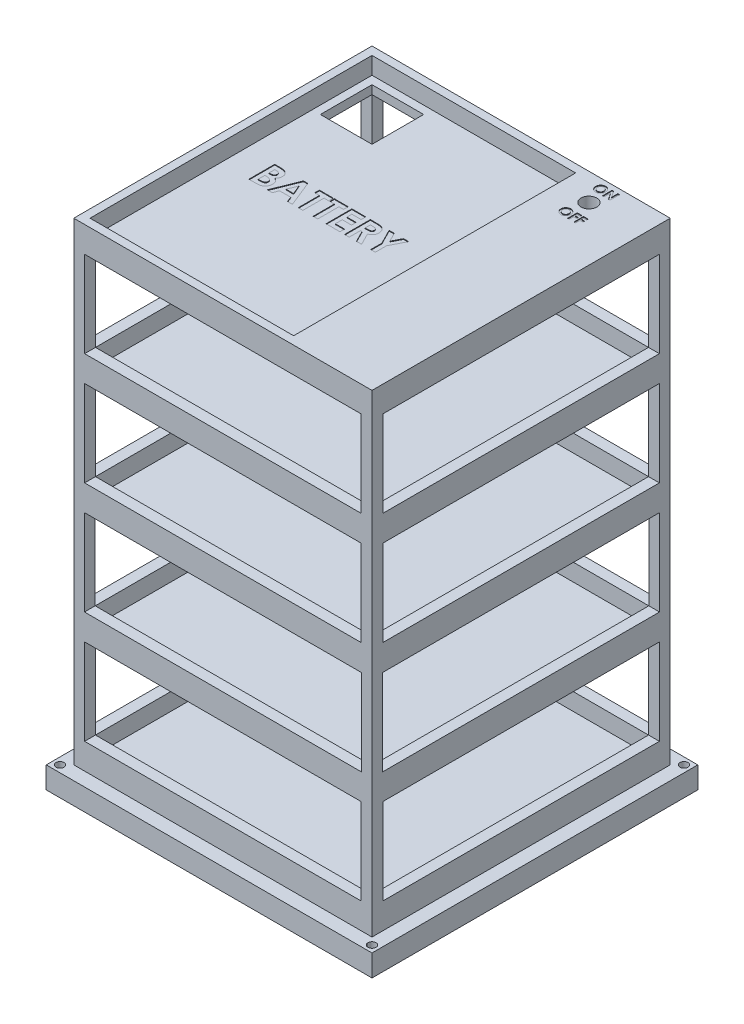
from build123d import *

# Parameters (mm, degrees)
SKETCH1_W            = 110
SKETCH1_H            = 110
BOSS_EXTRUDE1_DEPTH  = 9.525
SKETCH3_W            = 120.16
SKETCH3_H            = 120.16
BOSS_EXTRUDE2_DEPTH  = 8
SKETCH4_R            = 1.5
CUT_EXTRUDE2_DEPTH   = 86.498177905
SKETCH2_W            = 102
SKETCH2_H            = 102
CUT_EXTRUDE1_DEPTH   = 6.35
SKETCH5_W            = 4
SKETCH5_H            = 4
BOSS_EXTRUDE3_DEPTH  = 31.75
SKETCH6_W            = 110
SKETCH6_H            = 110
BOSS_EXTRUDE4_DEPTH  = 9.525
SKETCH7_W            = 102.108
SKETCH7_H            = 102.108
CUT_EXTRUDE3_DEPTH   = 6.35
SKETCH8_W            = 3.946
SKETCH8_H            = 3.946
BOSS_EXTRUDE5_DEPTH  = 31.75
SKETCH9_W            = 110
SKETCH9_H            = 110
BOSS_EXTRUDE6_DEPTH  = 9.525
SKETCH10_W           = 102
SKETCH10_H           = 102
CUT_EXTRUDE4_DEPTH   = 6.35
SKETCH11_W           = 4
SKETCH11_H           = 4
BOSS_EXTRUDE7_DEPTH  = 31.75
SKETCH12_W           = 110
SKETCH12_H           = 110
BOSS_EXTRUDE8_DEPTH  = 9.525
SKETCH13_W           = 102
SKETCH13_H           = 102
CUT_EXTRUDE5_DEPTH   = 6.35
SKETCH14_W           = 4
SKETCH14_H           = 4
BOSS_EXTRUDE9_DEPTH  = 31.75
SKETCH15_W           = 110
SKETCH15_H           = 110
BOSS_EXTRUDE10_DEPTH = 9.525
SKETCH16_W           = 75.1
SKETCH16_H           = 104
CUT_EXTRUDE6_DEPTH   = 6.35
SKETCH17_R           = 2.9
CUT_EXTRUDE7_DEPTH   = 6.35
CUT_EXTRUDE8_REACH   = 197.684
SKETCH19_W           = 19.05
SKETCH19_H           = 19.05
CUT_EXTRUDE9_DEPTH   = 0.25
CUT_EXTRUDE11_DEPTH  = 0.25
CUT_EXTRUDE12_DEPTH  = 0.25


with BuildPart() as part:
    # Sketch1 → Boss-Extrude1 (new body)
    with BuildSketch(Plane(origin=(0, 0, 0), x_dir=(1, 0, 0), z_dir=(0, 1, 0))):
        Rectangle(SKETCH1_W, SKETCH1_H)
    extrude(amount=BOSS_EXTRUDE1_DEPTH)

    # Sketch3 → Boss-Extrude2 (add)
    with BuildSketch(Plane.XZ):
        Rectangle(SKETCH3_W, SKETCH3_H)
    extrude(amount=BOSS_EXTRUDE2_DEPTH)

    # Sketch4 → Cut-Extrude2 (cut, through all)
    with BuildSketch(Plane(origin=(0, 0, 0), x_dir=(1, 0, 0), z_dir=(0, 1, 0))):
        with Locations(Location((-57.54, 57.54, 0), (0, 0, 270))):
            Circle(SKETCH4_R)
        with Locations(Location((57.54, 57.54, 0), (0, 0, 90))):
            Circle(SKETCH4_R)
        with Locations(Location((57.54, -57.54, 0), (0, 0, 270))):
            Circle(SKETCH4_R)
        with Locations(Location((-57.54, -57.54, 0), (0, 0, 90))):
            Circle(SKETCH4_R)
    extrude(amount=-CUT_EXTRUDE2_DEPTH, mode=Mode.SUBTRACT)

    # Sketch2 → Cut-Extrude1 (cut)
    with BuildSketch(Plane(origin=(0, 9.525, 0), x_dir=(1, 0, 0), z_dir=(0, 1, 0))):
        Rectangle(SKETCH2_W, SKETCH2_H)
    extrude(amount=-CUT_EXTRUDE1_DEPTH, mode=Mode.SUBTRACT)

    # Sketch5 → Boss-Extrude3 (add)
    with BuildSketch(Plane(origin=(0, 9.525, 0), x_dir=(1, 0, 0), z_dir=(0, 1, 0))):
        with Locations((-53, 53)):
            Rectangle(SKETCH5_W, SKETCH5_H)
        with Locations((-53, -53)):
            Rectangle(SKETCH5_W, SKETCH5_H)
        with Locations((53, -53)):
            Rectangle(SKETCH5_W, SKETCH5_H)
        with Locations((53, 53)):
            Rectangle(SKETCH5_W, SKETCH5_H)
    extrude(amount=BOSS_EXTRUDE3_DEPTH)

    # Sketch6 → Boss-Extrude4 (add)
    with BuildSketch(Plane(origin=(0, 41.275, 0), x_dir=(1, 0, 0), z_dir=(0, 1, 0))):
        Rectangle(SKETCH6_W, SKETCH6_H)
    extrude(amount=BOSS_EXTRUDE4_DEPTH)

    # Sketch7 → Cut-Extrude3 (cut)
    with BuildSketch(Plane(origin=(0, 50.8, 0), x_dir=(1, 0, 0), z_dir=(0, 1, 0))):
        Rectangle(SKETCH7_W, SKETCH7_H)
    extrude(amount=-CUT_EXTRUDE3_DEPTH, mode=Mode.SUBTRACT)

    # Sketch8 → Boss-Extrude5 (add)
    with BuildSketch(Plane(origin=(0, 50.8, 0), x_dir=(1, 0, 0), z_dir=(0, 1, 0))):
        with Locations((-53.027, 53.027)):
            Rectangle(SKETCH8_W, SKETCH8_H)
        with Locations((53.027, 53.027)):
            Rectangle(SKETCH8_W, SKETCH8_H)
        with Locations((53.027, -53.027)):
            Rectangle(SKETCH8_W, SKETCH8_H)
        with Locations((-53.027, -53.027)):
            Rectangle(SKETCH8_W, SKETCH8_H)
    extrude(amount=BOSS_EXTRUDE5_DEPTH)

    # Sketch9 → Boss-Extrude6 (add)
    with BuildSketch(Plane(origin=(0, 82.55, 0), x_dir=(1, 0, 0), z_dir=(0, 1, 0))):
        Rectangle(SKETCH9_W, SKETCH9_H)
    extrude(amount=BOSS_EXTRUDE6_DEPTH)

    # Sketch10 → Cut-Extrude4 (cut)
    with BuildSketch(Plane(origin=(0, 92.075, 0), x_dir=(1, 0, 0), z_dir=(0, 1, 0))):
        Rectangle(SKETCH10_W, SKETCH10_H)
    extrude(amount=-CUT_EXTRUDE4_DEPTH, mode=Mode.SUBTRACT)

    # Sketch11 → Boss-Extrude7 (add)
    with BuildSketch(Plane(origin=(0, 92.075, 0), x_dir=(1, 0, 0), z_dir=(0, 1, 0))):
        with Locations((-53, 53)):
            Rectangle(SKETCH11_W, SKETCH11_H)
        with Locations((53, 53)):
            Rectangle(SKETCH11_W, SKETCH11_H)
        with Locations((53, -53)):
            Rectangle(SKETCH11_W, SKETCH11_H)
        with Locations((-53, -53)):
            Rectangle(SKETCH11_W, SKETCH11_H)
    extrude(amount=BOSS_EXTRUDE7_DEPTH)

    # Sketch12 → Boss-Extrude8 (add)
    with BuildSketch(Plane(origin=(0, 123.825, 0), x_dir=(1, 0, 0), z_dir=(0, 1, 0))):
        Rectangle(SKETCH12_W, SKETCH12_H)
    extrude(amount=BOSS_EXTRUDE8_DEPTH)

    # Sketch13 → Cut-Extrude5 (cut)
    with BuildSketch(Plane(origin=(0, 133.35, 0), x_dir=(1, 0, 0), z_dir=(0, 1, 0))):
        Rectangle(SKETCH13_W, SKETCH13_H)
    extrude(amount=-CUT_EXTRUDE5_DEPTH, mode=Mode.SUBTRACT)

    # Sketch14 → Boss-Extrude9 (add)
    with BuildSketch(Plane(origin=(0, 133.35, 0), x_dir=(1, 0, 0), z_dir=(0, 1, 0))):
        with Locations((-53, 53)):
            Rectangle(SKETCH14_W, SKETCH14_H)
        with Locations((53, 53)):
            Rectangle(SKETCH14_W, SKETCH14_H)
        with Locations((53, -53)):
            Rectangle(SKETCH14_W, SKETCH14_H)
        with Locations((-53, -53)):
            Rectangle(SKETCH14_W, SKETCH14_H)
    extrude(amount=BOSS_EXTRUDE9_DEPTH)

    # Sketch15 → Boss-Extrude10 (add)
    with BuildSketch(Plane(origin=(0, 165.1, 0), x_dir=(1, 0, 0), z_dir=(0, 1, 0))):
        Rectangle(SKETCH15_W, SKETCH15_H)
    extrude(amount=BOSS_EXTRUDE10_DEPTH)

    # Sketch16 → Cut-Extrude6 (cut)
    with BuildSketch(Plane(origin=(0, 174.625, 0), x_dir=(1, 0, 0), z_dir=(0, 1, 0))):
        with Locations((-14.45, 0)):
            Rectangle(SKETCH16_W, SKETCH16_H)
    extrude(amount=-CUT_EXTRUDE6_DEPTH, mode=Mode.SUBTRACT)

    # Sketch17 → Cut-Extrude7 (cut)
    with BuildSketch(Plane(origin=(0, 174.625, 0), x_dir=(1, 0, 0), z_dir=(0, 1, 0))):
        with Locations(Location((35, 45, 0), (0, 0, 270))):
            Circle(SKETCH17_R)
    extrude(amount=-CUT_EXTRUDE7_DEPTH, mode=Mode.SUBTRACT)

    # Sketch19 → Cut-Extrude8 (cut, up to next)
    with BuildSketch(Plane(origin=(0, 168.275, 0), x_dir=(1, 0, 0), z_dir=(0, 1, 0)), mode=Mode.PRIVATE) as cut_extrude8_sk1:
        with Locations((-39.475, 39.475)):
            Rectangle(SKETCH19_W, SKETCH19_H)
    cut_extrude8_tool1 = extrude(cut_extrude8_sk1.sketch, amount=-CUT_EXTRUDE8_REACH, mode=Mode.PRIVATE) & part.part
    add(cut_extrude8_tool1.solids().sort_by_distance((-39.475, 168.275, -39.475))[0], mode=Mode.SUBTRACT)

    # Sketch20 → Cut-Extrude9 (cut)
    # profile 1 of 2: a face of its own
    with BuildSketch(Plane(origin=(0, 174.625, 0), x_dir=(1, 0, 0), z_dir=(0, 1, 0))):
        with BuildLine():
            add(Edge.make_bspline(
                [(32.913621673, 53.270564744), (32.974473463, 53.268989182), (33.094608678, 53.265878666), (33.271284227, 53.239950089), (33.441543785, 53.197703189), (33.605310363, 53.138976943), (33.762173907, 53.062180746), (33.912687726, 52.969491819), (34.056312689, 52.859160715), (34.191577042, 52.733761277), (34.316585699, 52.597394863), (34.424905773, 52.450572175), (34.517277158, 52.297097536), (34.59383481, 52.136559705), (34.652147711, 51.967846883), (34.693068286, 51.79181928), (34.719357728, 51.608526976), (34.722381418, 51.4837299), (34.723918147, 51.420304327)],
                knots=[0, 0, 0, 0, 1.014329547, 2.002516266, 2.970391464, 3.935626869, 4.897733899, 5.877609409, 6.878433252, 7.912639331, 8.949961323, 9.958554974, 10.949718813, 11.932905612, 12.9188844, 13.919928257, 14.942845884, 16, 16, 16, 16], degree=3))
            add(Edge.make_bspline(
                [(34.723918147, 51.420304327), (34.722281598, 51.357593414), (34.719056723, 51.234019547), (34.694141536, 51.052416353), (34.652531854, 50.878274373), (34.595207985, 50.711199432), (34.5200388, 50.552000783), (34.429468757, 50.399661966), (34.321107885, 50.25559672), (34.19890853, 50.119882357), (34.064377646, 49.996692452), (33.921888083, 49.888131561), (33.77209777, 49.796141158), (33.615225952, 49.720763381), (33.450936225, 49.662265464), (33.279634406, 49.620990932), (33.101331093, 49.595907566), (32.980076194, 49.592703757), (32.918529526, 49.591077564)],
                knots=[0, 0, 0, 0, 1.051557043, 2.072126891, 3.067553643, 4.050577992, 5.02905126, 6.015227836, 7.017913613, 8.04756643, 9.074058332, 10.072836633, 11.047628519, 12.017157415, 12.98668631, 13.966869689, 14.968021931, 16, 16, 16, 16], degree=3))
            add(Edge.make_bspline(
                [(32.918529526, 49.591077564), (32.85415909, 49.592536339), (32.727679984, 49.595402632), (32.542577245, 49.622659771), (32.365232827, 49.663718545), (32.197136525, 49.724996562), (32.036576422, 49.801599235), (31.8847322, 49.89594002), (31.741654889, 50.007863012), (31.608165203, 50.13450182), (31.487223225, 50.273072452), (31.380468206, 50.419460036), (31.290417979, 50.572546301), (31.21706925, 50.732402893), (31.159244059, 50.898036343), (31.118454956, 51.070455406), (31.09435986, 51.249246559), (31.091003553, 51.370685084), (31.089302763, 51.432223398)],
                knots=[0, 0, 0, 0, 1.067978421, 2.098431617, 3.099715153, 4.085208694, 5.062210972, 6.048429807, 7.046490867, 8.072918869, 9.098532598, 10.095778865, 11.076610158, 12.041847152, 13.011192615, 13.984257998, 14.978533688, 16, 16, 16, 16], degree=3))
            add(Edge.make_bspline(
                [(31.089302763, 51.432223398), (31.089836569, 51.473623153), (31.090897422, 51.555898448), (31.103676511, 51.677826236), (31.122074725, 51.797374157), (31.149284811, 51.914065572), (31.18233811, 52.028723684), (31.225163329, 52.140281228), (31.273910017, 52.249929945), (31.330865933, 52.356374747), (31.394195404, 52.458636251), (31.463293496, 52.556232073), (31.538333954, 52.647982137), (31.619075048, 52.734489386), (31.705795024, 52.815185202), (31.797353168, 52.891211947), (31.895525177, 52.960550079), (31.998162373, 53.024892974), (32.104686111, 53.083077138), (32.214662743, 53.132601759), (32.325826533, 53.175850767), (32.439662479, 53.209984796), (32.554950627, 53.237786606), (32.672922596, 53.256172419), (32.792512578, 53.268951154), (32.87315617, 53.270025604), (32.913621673, 53.270564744)],
                knots=[0, 0, 0, 0, 1.034744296, 2.056386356, 3.06226378, 4.057406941, 5.050368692, 6.043467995, 7.042652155, 8.049140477, 9.059438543, 10.048523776, 11.036952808, 12.020949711, 13.004946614, 13.997082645, 14.994316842, 16.007702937, 17.024872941, 18.026463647, 19.021641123, 20.005082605, 20.995858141, 21.984425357, 22.988620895, 24, 24, 24, 24], degree=3))
        make_face()
        with BuildLine():
            add(Edge.make_bspline(
                [(32.903805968, 52.642359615), (32.862852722, 52.641260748), (32.782027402, 52.639092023), (32.663471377, 52.622569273), (32.549653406, 52.596180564), (32.441204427, 52.557956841), (32.337654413, 52.509307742), (32.238819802, 52.450403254), (32.146069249, 52.379218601), (32.058166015, 52.299575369), (31.978759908, 52.210834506), (31.908602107, 52.115733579), (31.849891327, 52.014431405), (31.800720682, 51.907869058), (31.763706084, 51.794848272), (31.737341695, 51.676254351), (31.720680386, 51.551882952), (31.718580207, 51.467099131), (31.717507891, 51.423809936)],
                knots=[0, 0, 0, 0, 1.033739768, 2.040188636, 3.016340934, 3.979330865, 4.937572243, 5.900995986, 6.878200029, 7.884839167, 8.891893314, 9.879764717, 10.863503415, 11.843163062, 12.837761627, 13.859916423, 14.907309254, 16, 16, 16, 16], degree=3))
            add(Edge.make_bspline(
                [(31.717507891, 51.423809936), (31.718929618, 51.37583577), (31.721715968, 51.281814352), (31.741321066, 51.144658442), (31.774863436, 51.015128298), (31.823297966, 50.893857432), (31.88336949, 50.779499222), (31.95796879, 50.67345529), (32.045887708, 50.575090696), (32.113619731, 50.517661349), (32.147996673, 50.488513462)],
                knots=[0, 0, 0, 0, 1.078454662, 2.113592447, 3.107694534, 4.079536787, 5.043276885, 6.005368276, 6.987637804, 8, 8, 8, 8], degree=3))
            add(Edge.make_bspline(
                [(32.147996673, 50.488513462), (32.176157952, 50.466980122), (32.23184603, 50.424398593), (32.320736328, 50.369821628), (32.412275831, 50.323043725), (32.507155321, 50.285247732), (32.605174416, 50.25551804), (32.706319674, 50.234698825), (32.810447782, 50.221632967), (32.880864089, 50.22007135), (32.91642616, 50.219282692)],
                knots=[0, 0, 0, 0, 1.023928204, 2.024787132, 3.009472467, 3.9914905, 4.972207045, 5.96565515, 6.972602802, 8, 8, 8, 8], degree=3))
            add(Edge.make_bspline(
                [(32.91642616, 50.219282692), (32.956675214, 50.220390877), (33.035866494, 50.222571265), (33.152215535, 50.238890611), (33.26368145, 50.266508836), (33.370956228, 50.304397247), (33.473730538, 50.353657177), (33.571502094, 50.414388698), (33.664442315, 50.485846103), (33.752233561, 50.566535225), (33.832478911, 50.655625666), (33.902490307, 50.751233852), (33.963067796, 50.851253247), (34.011215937, 50.957099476), (34.049692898, 51.067773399), (34.075739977, 51.183765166), (34.092542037, 51.304596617), (34.094642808, 51.386826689), (34.095713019, 51.428717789)],
                knots=[0, 0, 0, 0, 1.026359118, 2.019393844, 2.989460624, 3.950973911, 4.916101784, 5.890408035, 6.881132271, 7.902007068, 8.92769091, 9.933912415, 10.920395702, 11.90457117, 12.894218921, 13.903490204, 14.931958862, 16, 16, 16, 16], degree=3))
            add(Edge.make_bspline(
                [(34.095713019, 51.428717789), (34.094605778, 51.470368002), (34.092426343, 51.552350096), (34.076078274, 51.67287089), (34.048635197, 51.788350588), (34.01063301, 51.898977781), (33.962106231, 52.004860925), (33.902097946, 52.105627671), (33.830818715, 52.201180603), (33.749909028, 52.290868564), (33.661843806, 52.373286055), (33.56729699, 52.444809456), (33.468914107, 52.506961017), (33.364437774, 52.55564804), (33.256005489, 52.594436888), (33.142955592, 52.623001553), (33.024859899, 52.63897595), (32.944516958, 52.641221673), (32.903805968, 52.642359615)],
                knots=[0, 0, 0, 0, 1.055025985, 2.07665775, 3.074803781, 4.057872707, 5.035505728, 6.020516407, 7.023567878, 8.050795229, 9.077271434, 10.074415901, 11.050397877, 12.019801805, 12.988065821, 13.964604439, 14.968634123, 16, 16, 16, 16], degree=3))
        make_face(mode=Mode.SUBTRACT)
    # profile 2 of 2: a face of its own
    with BuildSketch(Plane(origin=(0, 174.625, 0), x_dir=(1, 0, 0), z_dir=(0, 1, 0))):
        Polygon((35.352123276, 53.180821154), (35.917928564, 53.180821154), (37.50596943, 50.877636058), (37.50596943, 53.180821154), (38.134174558, 53.180821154), (38.134174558, 49.680821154), (37.564162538, 49.680821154), (35.980328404, 51.976995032), (35.980328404, 49.680821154), (35.352123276, 49.680821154), align=None)
    extrude(amount=-CUT_EXTRUDE9_DEPTH, mode=Mode.SUBTRACT)

    # Sketch22 → Cut-Extrude11 (cut)
    # profile 1 of 3: a face of its own
    with BuildSketch(Plane(origin=(0, 174.625, 0), x_dir=(1, 0, 0), z_dir=(0, 1, 0))):
        with BuildLine():
            add(Edge.make_bspline(
                [(33.673161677, 39.667893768), (33.734013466, 39.666318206), (33.854148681, 39.66320769), (34.03082423, 39.637279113), (34.201083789, 39.595032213), (34.364850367, 39.536305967), (34.52171391, 39.459509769), (34.67222773, 39.366820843), (34.815852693, 39.256489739), (34.951117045, 39.131090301), (35.076125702, 38.994723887), (35.184445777, 38.847901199), (35.276817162, 38.69442656), (35.353374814, 38.533888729), (35.411687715, 38.365175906), (35.45260829, 38.189148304), (35.478897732, 38.005856), (35.481921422, 37.881058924), (35.483458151, 37.817633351)],
                knots=[0, 0, 0, 0, 1.014329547, 2.002516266, 2.970391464, 3.935626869, 4.897733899, 5.877609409, 6.878433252, 7.912639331, 8.949961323, 9.958554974, 10.949718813, 11.932905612, 12.9188844, 13.919928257, 14.942845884, 16, 16, 16, 16], degree=3))
            add(Edge.make_bspline(
                [(35.483458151, 37.817633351), (35.481821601, 37.754922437), (35.478596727, 37.63134857), (35.45368154, 37.449745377), (35.412071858, 37.275603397), (35.354747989, 37.108528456), (35.279578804, 36.949329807), (35.189008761, 36.79699099), (35.080647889, 36.652925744), (34.958448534, 36.517211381), (34.82391765, 36.394021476), (34.681428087, 36.285460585), (34.531637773, 36.193470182), (34.374765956, 36.118092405), (34.210476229, 36.059594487), (34.03917441, 36.018319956), (33.860871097, 35.99323659), (33.739616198, 35.990032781), (33.678069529, 35.988406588)],
                knots=[0, 0, 0, 0, 1.051557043, 2.072126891, 3.067553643, 4.050577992, 5.02905126, 6.015227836, 7.017913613, 8.04756643, 9.074058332, 10.072836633, 11.047628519, 12.017157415, 12.98668631, 13.966869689, 14.968021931, 16, 16, 16, 16], degree=3))
            add(Edge.make_bspline(
                [(33.678069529, 35.988406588), (33.613699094, 35.989865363), (33.487219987, 35.992731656), (33.302117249, 36.019988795), (33.124772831, 36.061047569), (32.956676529, 36.122325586), (32.796116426, 36.198928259), (32.644272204, 36.293269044), (32.501194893, 36.405192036), (32.367705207, 36.531830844), (32.246763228, 36.670401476), (32.14000821, 36.81678906), (32.049957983, 36.969875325), (31.976609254, 37.129731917), (31.918784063, 37.295365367), (31.87799496, 37.46778443), (31.853899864, 37.646575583), (31.850543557, 37.768014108), (31.848842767, 37.829552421)],
                knots=[0, 0, 0, 0, 1.067978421, 2.098431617, 3.099715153, 4.085208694, 5.062210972, 6.048429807, 7.046490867, 8.072918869, 9.098532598, 10.095778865, 11.076610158, 12.041847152, 13.011192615, 13.984257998, 14.978533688, 16, 16, 16, 16], degree=3))
            add(Edge.make_bspline(
                [(31.848842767, 37.829552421), (31.849376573, 37.870952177), (31.850437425, 37.953227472), (31.863216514, 38.07515526), (31.881614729, 38.194703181), (31.908824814, 38.311394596), (31.941878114, 38.426052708), (31.984703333, 38.537610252), (32.033450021, 38.647258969), (32.090405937, 38.753703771), (32.153735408, 38.855965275), (32.2228335, 38.953561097), (32.297873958, 39.045311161), (32.378615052, 39.13181841), (32.465335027, 39.212514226), (32.556893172, 39.28854097), (32.655065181, 39.357879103), (32.757702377, 39.422221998), (32.864226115, 39.480406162), (32.974202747, 39.529930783), (33.085366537, 39.573179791), (33.199202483, 39.60731382), (33.31449063, 39.635115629), (33.4324626, 39.653501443), (33.552052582, 39.666280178), (33.632696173, 39.667354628), (33.673161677, 39.667893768)],
                knots=[0, 0, 0, 0, 1.034744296, 2.056386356, 3.06226378, 4.057406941, 5.050368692, 6.043467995, 7.042652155, 8.049140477, 9.059438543, 10.048523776, 11.036952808, 12.020949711, 13.004946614, 13.997082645, 14.994316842, 16.007702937, 17.024872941, 18.026463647, 19.021641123, 20.005082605, 20.995858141, 21.984425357, 22.988620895, 24, 24, 24, 24], degree=3))
        make_face()
        with BuildLine():
            add(Edge.make_bspline(
                [(33.663345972, 39.039688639), (33.622392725, 39.038589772), (33.541567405, 39.036421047), (33.42301138, 39.019898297), (33.309193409, 38.993509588), (33.200744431, 38.955285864), (33.097194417, 38.906636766), (32.998359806, 38.847732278), (32.905609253, 38.776547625), (32.817706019, 38.696904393), (32.738299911, 38.60816353), (32.66814211, 38.513062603), (32.609431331, 38.411760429), (32.560260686, 38.305198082), (32.523246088, 38.192177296), (32.496881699, 38.073583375), (32.48022039, 37.949211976), (32.478120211, 37.864428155), (32.477047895, 37.82113896)],
                knots=[0, 0, 0, 0, 1.033739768, 2.040188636, 3.016340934, 3.979330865, 4.937572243, 5.900995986, 6.878200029, 7.884839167, 8.891893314, 9.879764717, 10.863503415, 11.843163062, 12.837761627, 13.859916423, 14.907309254, 16, 16, 16, 16], degree=3))
            add(Edge.make_bspline(
                [(32.477047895, 37.82113896), (32.478469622, 37.773164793), (32.481255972, 37.679143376), (32.500861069, 37.541987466), (32.534403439, 37.412457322), (32.58283797, 37.291186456), (32.642909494, 37.176828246), (32.717508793, 37.070784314), (32.805427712, 36.97241972), (32.873159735, 36.914990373), (32.907536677, 36.885842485)],
                knots=[0, 0, 0, 0, 1.078454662, 2.113592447, 3.107694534, 4.079536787, 5.043276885, 6.005368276, 6.987637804, 8, 8, 8, 8], degree=3))
            add(Edge.make_bspline(
                [(32.907536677, 36.885842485), (32.935697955, 36.864309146), (32.991386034, 36.821727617), (33.080276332, 36.767150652), (33.171815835, 36.720372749), (33.266695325, 36.682576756), (33.364714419, 36.652847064), (33.465859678, 36.632027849), (33.569987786, 36.618961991), (33.640404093, 36.617400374), (33.675966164, 36.616611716)],
                knots=[0, 0, 0, 0, 1.023928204, 2.024787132, 3.009472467, 3.9914905, 4.972207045, 5.96565515, 6.972602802, 8, 8, 8, 8], degree=3))
            add(Edge.make_bspline(
                [(33.675966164, 36.616611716), (33.716215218, 36.617719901), (33.795406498, 36.619900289), (33.911755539, 36.636219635), (34.023221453, 36.66383786), (34.130496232, 36.701726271), (34.233270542, 36.750986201), (34.331042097, 36.811717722), (34.423982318, 36.883175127), (34.511773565, 36.963864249), (34.592018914, 37.05295469), (34.662030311, 37.148562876), (34.722607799, 37.248582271), (34.77075594, 37.3544285), (34.809232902, 37.465102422), (34.835279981, 37.58109419), (34.852082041, 37.701925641), (34.854182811, 37.784155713), (34.855253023, 37.826046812)],
                knots=[0, 0, 0, 0, 1.026359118, 2.019393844, 2.989460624, 3.950973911, 4.916101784, 5.890408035, 6.881132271, 7.902007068, 8.92769091, 9.933912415, 10.920395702, 11.90457117, 12.894218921, 13.903490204, 14.931958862, 16, 16, 16, 16], degree=3))
            add(Edge.make_bspline(
                [(34.855253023, 37.826046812), (34.854145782, 37.867697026), (34.851966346, 37.94967912), (34.835618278, 38.070199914), (34.8081752, 38.185679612), (34.770173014, 38.296306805), (34.721646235, 38.402189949), (34.661637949, 38.502956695), (34.590358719, 38.598509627), (34.509449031, 38.688197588), (34.421383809, 38.770615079), (34.326836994, 38.84213848), (34.228454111, 38.904290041), (34.123977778, 38.952977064), (34.015545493, 38.991765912), (33.902495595, 39.020330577), (33.784399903, 39.036304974), (33.704056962, 39.038550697), (33.663345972, 39.039688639)],
                knots=[0, 0, 0, 0, 1.055025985, 2.07665775, 3.074803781, 4.057872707, 5.035505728, 6.020516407, 7.023567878, 8.050795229, 9.077271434, 10.074415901, 11.050397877, 12.019801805, 12.988065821, 13.964604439, 14.968634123, 16, 16, 16, 16], degree=3))
        make_face(mode=Mode.SUBTRACT)
    # profile 2 of 3: a face of its own
    with BuildSketch(Plane(origin=(0, 174.625, 0), x_dir=(1, 0, 0), z_dir=(0, 1, 0))):
        Polygon((36.111663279, 39.578150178), (37.816791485, 39.578150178), (37.816791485, 38.94994505), (36.739868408, 38.94994505), (36.739868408, 38.276868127), (37.816791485, 38.276868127), (37.816791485, 37.648662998), (36.739868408, 37.648662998), (36.739868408, 36.078150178), (36.111663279, 36.078150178), align=None)
    # profile 3 of 3: a face of its own
    with BuildSketch(Plane(origin=(0, 174.625, 0), x_dir=(1, 0, 0), z_dir=(0, 1, 0))):
        Polygon((38.444996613, 39.578150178), (40.150124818, 39.578150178), (40.150124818, 38.94994505), (39.073201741, 38.94994505), (39.073201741, 38.276868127), (40.150124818, 38.276868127), (40.150124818, 37.648662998), (39.073201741, 37.648662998), (39.073201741, 36.078150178), (38.444996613, 36.078150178), align=None)
    extrude(amount=-CUT_EXTRUDE11_DEPTH, mode=Mode.SUBTRACT)

    # Sketch23 → Cut-Extrude12 (cut)
    # profile 1 of 7: a face of its own
    with BuildSketch(Plane(origin=(0, 168.275, 0), x_dir=(1, 0, 0), z_dir=(0, 1, 0))):
        with BuildLine():
            Line((-41.504250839, -3.901273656), (-41.504250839, 5.623726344))
            Line((-41.504250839, 5.623726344), (-39.977808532, 5.623726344))
            add(Edge.make_bspline(
                [(-39.977808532, 5.623726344), (-39.870948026, 5.62373854), (-39.664174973, 5.623762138), (-39.36585542, 5.613286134), (-39.089189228, 5.599734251), (-38.835056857, 5.584572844), (-38.603025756, 5.558446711), (-38.393448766, 5.530912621), (-38.20590715, 5.497708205), (-38.089960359, 5.467922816), (-38.035410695, 5.453909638)],
                knots=[0, 0, 0, 0, 1.311965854, 2.538629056, 3.664479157, 4.713267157, 5.663616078, 6.530575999, 7.308677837, 8, 8, 8, 8], degree=3))
            add(Edge.make_bspline(
                [(-38.035410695, 5.453909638), (-37.963781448, 5.434143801), (-37.823221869, 5.395356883), (-37.621895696, 5.317025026), (-37.430909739, 5.229953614), (-37.250497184, 5.130621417), (-37.081765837, 5.017829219), (-36.925356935, 4.890681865), (-36.777897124, 4.754283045), (-36.644622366, 4.604831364), (-36.524163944, 4.446907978), (-36.419507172, 4.280554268), (-36.328573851, 4.108313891), (-36.255803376, 3.928019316), (-36.20097219, 3.740500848), (-36.160868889, 3.546559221), (-36.13487652, 3.345580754), (-36.132420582, 3.208848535), (-36.131173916, 3.139441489)],
                knots=[0, 0, 0, 0, 1.099996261, 2.158545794, 3.195537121, 4.207578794, 5.205712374, 6.197378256, 7.190519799, 8.17788031, 9.159561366, 10.129234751, 11.085776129, 12.040971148, 13.00380137, 13.975669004, 14.972423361, 16, 16, 16, 16], degree=3))
            add(Edge.make_bspline(
                [(-36.131173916, 3.139441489), (-36.134433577, 3.050271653), (-36.14084982, 2.874751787), (-36.181837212, 2.616944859), (-36.25869496, 2.373280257), (-36.359261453, 2.139267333), (-36.496000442, 1.915778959), (-36.669632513, 1.702921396), (-36.877345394, 1.49414044), (-37.036672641, 1.36899034), (-37.11954531, 1.303894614)],
                knots=[0, 0, 0, 0, 0.986156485, 1.941127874, 2.875419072, 3.804401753, 4.751181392, 5.761612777, 6.835722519, 8, 8, 8, 8], degree=3))
            add(Edge.make_bspline(
                [(-37.11954531, 1.303894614), (-37.052389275, 1.26961204), (-36.920714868, 1.202393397), (-36.733775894, 1.091906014), (-36.560690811, 0.97438867), (-36.400683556, 0.852205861), (-36.257110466, 0.72017808), (-36.124043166, 0.585912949), (-36.008046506, 0.441717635), (-35.904318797, 0.292731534), (-35.814160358, 0.136797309), (-35.7356423, -0.025821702), (-35.669320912, -0.195681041), (-35.613158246, -0.371916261), (-35.571272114, -0.555133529), (-35.543961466, -0.745398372), (-35.523050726, -0.942061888), (-35.521424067, -1.076024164), (-35.520596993, -1.144137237)],
                knots=[0, 0, 0, 0, 1.164658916, 2.283573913, 3.35186032, 4.395461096, 5.390182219, 6.362969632, 7.312859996, 8.245001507, 9.165155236, 10.092416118, 11.032087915, 11.979892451, 12.947605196, 13.931445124, 14.948243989, 16, 16, 16, 16], degree=3))
            add(Edge.make_bspline(
                [(-35.520596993, -1.144137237), (-35.525964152, -1.274229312), (-35.536556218, -1.530965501), (-35.61400024, -1.907913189), (-35.748263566, -2.265293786), (-35.928551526, -2.601686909), (-36.150700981, -2.907354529), (-36.406109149, -3.175116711), (-36.692204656, -3.401771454), (-36.95616234, -3.554745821), (-37.18446495, -3.657405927), (-37.373563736, -3.720876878), (-37.576651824, -3.779676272), (-37.7974493, -3.82096642), (-38.031953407, -3.858759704), (-38.282450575, -3.88209406), (-38.548472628, -3.897907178), (-38.731188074, -3.90012881), (-38.825344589, -3.901273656)],
                knots=[0, 0, 0, 0, 1.284142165, 2.534249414, 3.780121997, 5.041676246, 6.291546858, 7.49970053, 8.684500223, 9.883330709, 10.50184324, 11.153274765, 11.851151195, 12.587658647, 13.369265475, 14.195992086, 15.070362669, 16, 16, 16, 16], degree=3))
            Line((-38.825344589, -3.901273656), (-41.504250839, -3.901273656))
        make_face()
        with BuildLine():
            Line((-39.794635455, 3.91411096), (-39.794635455, 1.838149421))
            Line((-39.794635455, 1.838149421), (-39.340518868, 1.838149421))
            add(Edge.make_bspline(
                [(-39.340518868, 1.838149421), (-39.278800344, 1.83868763), (-39.159656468, 1.83972661), (-38.987565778, 1.853108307), (-38.827549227, 1.875938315), (-38.680213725, 1.907791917), (-38.544186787, 1.948241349), (-38.420337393, 1.996910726), (-38.309210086, 2.056292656), (-38.180105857, 2.144744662), (-38.043633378, 2.274905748), (-37.923498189, 2.462950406), (-37.852739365, 2.679201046), (-37.844858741, 2.831717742), (-37.840789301, 2.910475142)],
                knots=[0, 0, 0, 0, 1.065314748, 2.056525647, 2.977365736, 3.853934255, 4.656397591, 5.425096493, 6.14721249, 6.826394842, 8.123232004, 9.372140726, 10.643011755, 12, 12, 12, 12], degree=3))
            add(Edge.make_bspline(
                [(-37.840789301, 2.910475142), (-37.844045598, 2.984244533), (-37.850341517, 3.126874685), (-37.921586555, 3.327140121), (-38.032244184, 3.504616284), (-38.162891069, 3.626084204), (-38.285920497, 3.709043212), (-38.391265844, 3.763668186), (-38.506890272, 3.812567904), (-38.635032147, 3.849957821), (-38.774959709, 3.878013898), (-38.925993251, 3.898617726), (-39.088393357, 3.912641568), (-39.200563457, 3.913610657), (-39.258472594, 3.91411096)],
                knots=[0, 0, 0, 0, 1.347982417, 2.606269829, 3.849316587, 5.153353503, 5.842674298, 6.568177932, 7.326619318, 8.142485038, 9.012069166, 9.942760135, 10.937925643, 12, 12, 12, 12], degree=3))
            Line((-39.258472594, 3.91411096), (-39.794635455, 3.91411096))
        make_face(mode=Mode.SUBTRACT)
        with BuildLine():
            Line((-39.794635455, 0.250649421), (-39.794635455, -2.191658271))
            Line((-39.794635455, -2.191658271), (-39.30235781, -2.191658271))
            add(Edge.make_bspline(
                [(-39.30235781, -2.191658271), (-39.205033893, -2.191102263), (-39.017916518, -2.190033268), (-38.74987121, -2.177117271), (-38.506151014, -2.153838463), (-38.287401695, -2.124776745), (-38.0932882, -2.085402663), (-37.924466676, -2.035343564), (-37.778621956, -1.980269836), (-37.656628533, -1.912247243), (-37.556966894, -1.833085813), (-37.467032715, -1.75218093), (-37.393705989, -1.658849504), (-37.335688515, -1.557097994), (-37.285474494, -1.449453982), (-37.255188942, -1.331714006), (-37.232130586, -1.207367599), (-37.230861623, -1.121359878), (-37.230212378, -1.077355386)],
                knots=[0, 0, 0, 0, 1.753078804, 3.370512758, 4.83203934, 6.162291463, 7.344201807, 8.395507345, 9.331626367, 10.147333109, 10.898971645, 11.62040215, 12.321813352, 13.025280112, 13.727906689, 14.453419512, 15.208716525, 16, 16, 16, 16], degree=3))
            add(Edge.make_bspline(
                [(-37.230212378, -1.077355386), (-37.231644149, -1.027035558), (-37.234432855, -0.929026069), (-37.257208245, -0.785774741), (-37.298598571, -0.652040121), (-37.350731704, -0.524402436), (-37.42327773, -0.407431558), (-37.509496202, -0.297079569), (-37.613670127, -0.197083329), (-37.730819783, -0.10139469), (-37.867463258, -0.017614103), (-38.023664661, 0.055080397), (-38.200272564, 0.115792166), (-38.397834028, 0.164130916), (-38.615482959, 0.205155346), (-38.854807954, 0.229651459), (-39.113815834, 0.247870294), (-39.293416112, 0.249701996), (-39.386312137, 0.250649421)],
                knots=[0, 0, 0, 0, 0.845221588, 1.646264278, 2.427170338, 3.19324141, 3.95557735, 4.731569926, 5.540061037, 6.376114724, 7.268642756, 8.224665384, 9.265483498, 10.400594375, 11.639216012, 12.983232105, 14.439614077, 16, 16, 16, 16], degree=3))
            Line((-39.386312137, 0.250649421), (-39.794635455, 0.250649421))
        make_face(mode=Mode.SUBTRACT)
    # profile 2 of 7: a face of its own
    with BuildSketch(Plane(origin=(0, 168.275, 0), x_dir=(1, 0, 0), z_dir=(0, 1, 0))):
        Polygon((-30.882120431, 5.623726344), (-29.292712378, 5.623726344), (-25.446077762, -3.901273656), (-27.272084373, -3.901273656), (-28.012408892, -1.947427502), (-32.15860781, -1.947427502), (-32.900840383, -3.901273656), (-34.726846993, -3.901273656), align=None)
        Polygon((-30.086462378, 3.068843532), (-31.50986983, -0.237812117), (-28.661146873, -0.237812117), align=None, mode=Mode.SUBTRACT)
    # profile 3 of 7: a face of its own
    with BuildSketch(Plane(origin=(0, 168.275, 0), x_dir=(1, 0, 0), z_dir=(0, 1, 0))):
        Polygon((-25.018673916, 5.623726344), (-19.889827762, 5.623726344), (-19.889827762, 3.91411096), (-21.599443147, 3.91411096), (-21.599443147, -3.901273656), (-23.309058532, -3.901273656), (-23.309058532, 3.91411096), (-25.018673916, 3.91411096), align=None)
    # profile 4 of 7: a face of its own
    with BuildSketch(Plane(origin=(0, 168.275, 0), x_dir=(1, 0, 0), z_dir=(0, 1, 0))):
        Polygon((-19.523481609, 5.623726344), (-14.394635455, 5.623726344), (-14.394635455, 3.91411096), (-16.104250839, 3.91411096), (-16.104250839, -3.901273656), (-17.813866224, -3.901273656), (-17.813866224, 3.91411096), (-19.523481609, 3.91411096), align=None)
    # profile 5 of 7: a face of its own
    with BuildSketch(Plane(origin=(0, 168.275, 0), x_dir=(1, 0, 0), z_dir=(0, 1, 0))):
        Polygon((-13.051366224, 5.623726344), (-7.92252007, 5.623726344), (-7.92252007, 3.91411096), (-11.341750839, 3.91411096), (-11.341750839, 2.082380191), (-7.92252007, 2.082380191), (-7.92252007, 0.372764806), (-11.341750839, 0.372764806), (-11.341750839, -2.191658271), (-7.92252007, -2.191658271), (-7.92252007, -3.901273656), (-13.051366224, -3.901273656), align=None)
    # profile 6 of 7: a face of its own
    with BuildSketch(Plane(origin=(0, 168.275, 0), x_dir=(1, 0, 0), z_dir=(0, 1, 0))):
        with BuildLine():
            Line((-6.212904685, 5.623726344), (-4.220897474, 5.623726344))
            add(Edge.make_bspline(
                [(-4.220897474, 5.623726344), (-4.089226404, 5.623258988), (-3.835985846, 5.622360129), (-3.470826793, 5.608178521), (-3.135377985, 5.588443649), (-2.82914276, 5.55832771), (-2.552252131, 5.518397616), (-2.304428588, 5.471326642), (-2.085679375, 5.417679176), (-1.894159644, 5.3508302), (-1.721322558, 5.275425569), (-1.560214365, 5.188784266), (-1.407280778, 5.091871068), (-1.263543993, 4.982135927), (-1.127754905, 4.861552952), (-0.999657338, 4.730000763), (-0.88106143, 4.586363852), (-0.772701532, 4.431549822), (-0.673940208, 4.268689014), (-0.586655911, 4.097557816), (-0.515676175, 3.91803722), (-0.45295797, 3.732721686), (-0.407784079, 3.538962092), (-0.376366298, 3.338644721), (-0.353363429, 3.131064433), (-0.352040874, 2.990043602), (-0.351366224, 2.918107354)],
                knots=[0, 0, 0, 0, 1.749336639, 3.364467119, 4.854658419, 6.213483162, 7.451590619, 8.570285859, 9.5643256, 10.440900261, 11.26203566, 12.067320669, 12.869050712, 13.665104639, 14.467235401, 15.27997916, 16.102287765, 16.939272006, 17.78853747, 18.631303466, 19.488103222, 20.351255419, 21.228522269, 22.127379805, 23.044756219, 24, 24, 24, 24], degree=3))
            add(Edge.make_bspline(
                [(-0.351366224, 2.918107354), (-0.353118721, 2.843022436), (-0.356555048, 2.695794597), (-0.375064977, 2.479528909), (-0.408895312, 2.272621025), (-0.460136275, 2.075676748), (-0.519031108, 1.886244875), (-0.597346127, 1.707820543), (-0.685732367, 1.537808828), (-0.790706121, 1.378614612), (-0.905909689, 1.226701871), (-1.039889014, 1.087890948), (-1.183964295, 0.954721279), (-1.346234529, 0.835534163), (-1.519546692, 0.722270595), (-1.707344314, 0.61962364), (-1.908401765, 0.525012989), (-2.04975511, 0.472251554), (-2.122039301, 0.445270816)],
                knots=[0, 0, 0, 0, 1.099860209, 2.156625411, 3.176576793, 4.16617041, 5.135385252, 6.078461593, 7.016046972, 7.938469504, 8.868247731, 9.803980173, 10.76021508, 11.73834243, 12.748633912, 13.790971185, 14.870363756, 16, 16, 16, 16], degree=3))
            Line((-2.122039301, 0.445270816), (0.076037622, -3.901273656))
            Line((0.076037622, -3.901273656), (-1.824383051, -3.901273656))
            Line((-1.824383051, -3.901273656), (-3.923241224, 0.250649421))
            Line((-3.923241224, 0.250649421), (-4.503289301, 0.250649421))
            Line((-4.503289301, 0.250649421), (-4.503289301, -3.901273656))
            Line((-4.503289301, -3.901273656), (-6.212904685, -3.901273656))
            Line((-6.212904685, -3.901273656), (-6.212904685, 5.623726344))
        make_face()
        with BuildLine():
            Line((-4.503289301, 1.960264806), (-3.837378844, 1.960264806))
            add(Edge.make_bspline(
                [(-3.837378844, 1.960264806), (-3.755965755, 1.961181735), (-3.600077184, 1.962937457), (-3.375888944, 1.971081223), (-3.172272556, 1.990703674), (-2.988353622, 2.015495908), (-2.823206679, 2.044122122), (-2.678304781, 2.085145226), (-2.551415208, 2.129102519), (-2.444041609, 2.183730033), (-2.352304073, 2.245853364), (-2.273094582, 2.316427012), (-2.207576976, 2.398107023), (-2.153652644, 2.488673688), (-2.111705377, 2.588928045), (-2.081087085, 2.697769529), (-2.063975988, 2.816437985), (-2.062007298, 2.898335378), (-2.060981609, 2.941003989)],
                knots=[0, 0, 0, 0, 1.688639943, 3.233382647, 4.650958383, 5.928841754, 7.082724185, 8.122798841, 9.049171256, 9.863274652, 10.613301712, 11.341792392, 12.054588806, 12.776240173, 13.521029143, 14.301969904, 15.115324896, 16, 16, 16, 16], degree=3))
            add(Edge.make_bspline(
                [(-2.060981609, 2.941003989), (-2.062920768, 2.99148407), (-2.066729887, 3.090642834), (-2.104528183, 3.233396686), (-2.164694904, 3.365525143), (-2.247167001, 3.486431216), (-2.351029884, 3.592425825), (-2.470220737, 3.685860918), (-2.607311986, 3.759742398), (-2.734248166, 3.808473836), (-2.84973042, 3.837630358), (-2.95394951, 3.85935754), (-3.074635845, 3.874756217), (-3.211880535, 3.891089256), (-3.365333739, 3.901680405), (-3.535831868, 3.909409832), (-3.722885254, 3.912572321), (-3.85327923, 3.913583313), (-3.921333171, 3.91411096)],
                knots=[0, 0, 0, 0, 1.020303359, 2.004196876, 2.966617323, 3.9489082, 4.950758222, 5.960522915, 7.003732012, 8.091992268, 8.70421221, 9.413913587, 10.24622431, 11.166358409, 12.212345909, 13.359657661, 14.621978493, 16, 16, 16, 16], degree=3))
            Line((-3.921333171, 3.91411096), (-4.503289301, 3.91411096))
            Line((-4.503289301, 3.91411096), (-4.503289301, 1.960264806))
        make_face(mode=Mode.SUBTRACT)
    # profile 7 of 7: a face of its own
    with BuildSketch(Plane(origin=(0, 168.275, 0), x_dir=(1, 0, 0), z_dir=(0, 1, 0))):
        Polygon((0.686614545, 5.623726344), (2.588943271, 5.623726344), (4.289018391, 2.280817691), (5.992909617, 5.623726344), (7.891422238, 5.623726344), (5.143826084, 0.223936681), (5.143826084, -3.901273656), (3.434210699, -3.901273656), (3.434210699, 0.223936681), align=None)
    extrude(amount=-CUT_EXTRUDE12_DEPTH, mode=Mode.SUBTRACT)


solid = part.part
